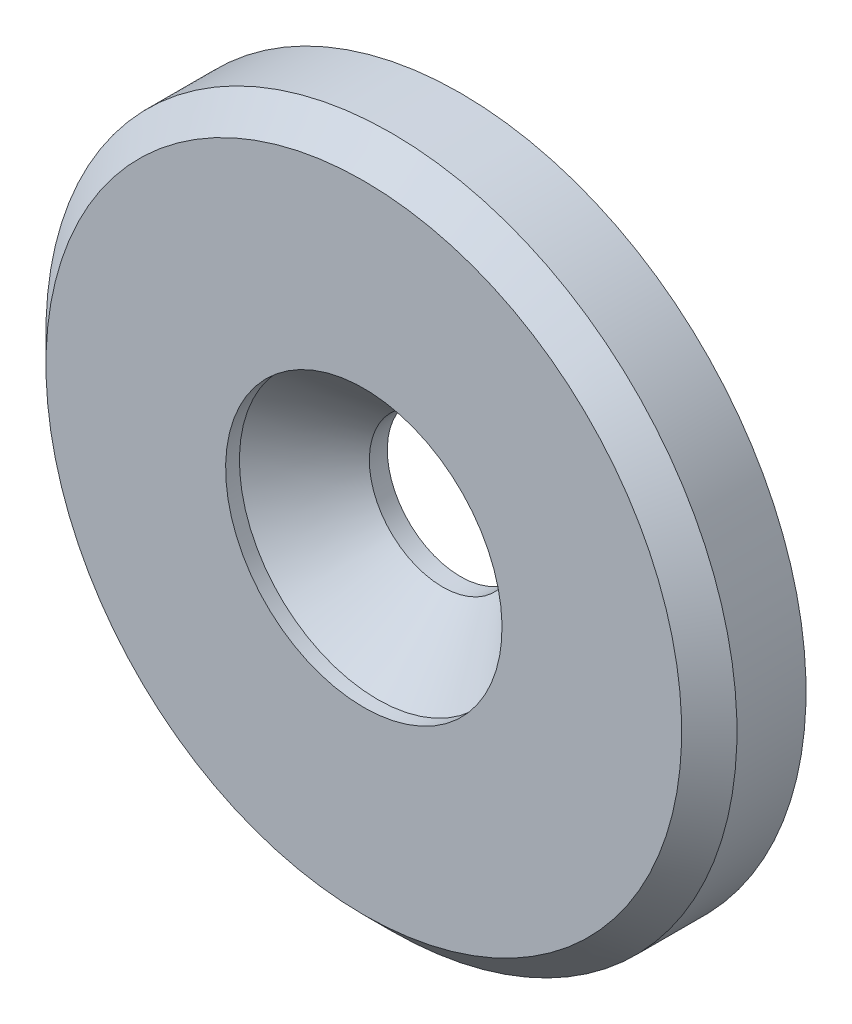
ISO-10303-21;
HEADER;
FILE_DESCRIPTION(('STEP AP214'),'2;1');
FILE_NAME('part.step','',(''),(''),'','','');
FILE_SCHEMA(('AUTOMOTIVE_DESIGN { 1 0 10303 214 1 1 1 1 }'));
ENDSEC;
DATA;
#1=APPLICATION_CONTEXT('core data for automotive mechanical design processes');
#2=APPLICATION_PROTOCOL_DEFINITION('international standard','automotive_design',2000,#1);
#3=PRODUCT_CONTEXT('',#1,'mechanical');
#4=PRODUCT('Part','Part','',(#3));
#5=PRODUCT_RELATED_PRODUCT_CATEGORY('part','',(#4));
#6=PRODUCT_DEFINITION_FORMATION('','',#4);
#7=PRODUCT_DEFINITION_CONTEXT('part definition',#1,'design');
#8=PRODUCT_DEFINITION('design','',#6,#7);
#9=PRODUCT_DEFINITION_SHAPE('','',#8);
#10=(LENGTH_UNIT() NAMED_UNIT(*) SI_UNIT(.MILLI.,.METRE.));
#11=(NAMED_UNIT(*) PLANE_ANGLE_UNIT() SI_UNIT($,.RADIAN.));
#12=(NAMED_UNIT(*) SI_UNIT($,.STERADIAN.) SOLID_ANGLE_UNIT());
#13=UNCERTAINTY_MEASURE_WITH_UNIT(LENGTH_MEASURE(1.E-05),#10,'distance_accuracy_value','');
#14=(GEOMETRIC_REPRESENTATION_CONTEXT(3) GLOBAL_UNCERTAINTY_ASSIGNED_CONTEXT((#13)) GLOBAL_UNIT_ASSIGNED_CONTEXT((#10,
#11,#12)) REPRESENTATION_CONTEXT('',''));
#15=CARTESIAN_POINT('',(0.,0.,0.));
#16=DIRECTION('',(0.,0.,1.));
#17=DIRECTION('',(1.,0.,0.));
#18=AXIS2_PLACEMENT_3D('',#15,#16,#17);
#19=CARTESIAN_POINT('',(0.,0.,0.65));
#20=DIRECTION('',(0.,0.,1.));
#21=DIRECTION('',(0.,-1.,0.));
#22=AXIS2_PLACEMENT_3D('',#19,#20,#21);
#23=CONICAL_SURFACE('',#22,2.65,0.785398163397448);
#24=CARTESIAN_POINT('',(0.,0.,3.));
#25=DIRECTION('',(0.,0.,1.));
#26=DIRECTION('',(0.,-1.,0.));
#27=AXIS2_PLACEMENT_3D('',#24,#25,#26);
#28=CIRCLE('',#27,5.);
#29=CARTESIAN_POINT('',(0.,-5.,3.));
#30=VERTEX_POINT('',#29);
#31=EDGE_CURVE('E37',#30,#30,#28,.T.);
#32=ORIENTED_EDGE('',*,*,#31,.T.);
#33=EDGE_LOOP('',(#32));
#34=FACE_BOUND('',#33,.T.);
#35=CARTESIAN_POINT('',(0.,0.,0.65));
#36=DIRECTION('',(0.,0.,1.));
#37=DIRECTION('',(0.,-1.,0.));
#38=AXIS2_PLACEMENT_3D('',#35,#36,#37);
#39=CIRCLE('',#38,2.65);
#40=CARTESIAN_POINT('',(0.,-2.65,0.65));
#41=VERTEX_POINT('',#40);
#42=EDGE_CURVE('E8',#41,#41,#39,.T.);
#43=ORIENTED_EDGE('',*,*,#42,.F.);
#44=EDGE_LOOP('',(#43));
#45=FACE_BOUND('',#44,.T.);
#46=ADVANCED_FACE('F12',(#34,#45),#23,.F.);
#47=CARTESIAN_POINT('',(0.,0.,3.87165171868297));
#48=DIRECTION('',(0.,0.,1.));
#49=DIRECTION('',(0.,-1.,0.));
#50=AXIS2_PLACEMENT_3D('',#47,#48,#49);
#51=CYLINDRICAL_SURFACE('',#50,2.65);
#52=ORIENTED_EDGE('',*,*,#42,.T.);
#53=EDGE_LOOP('',(#52));
#54=FACE_BOUND('',#53,.T.);
#55=CARTESIAN_POINT('',(0.,0.,0.));
#56=DIRECTION('',(0.,0.,1.));
#57=DIRECTION('',(0.,-1.,0.));
#58=AXIS2_PLACEMENT_3D('',#55,#56,#57);
#59=CIRCLE('',#58,2.65);
#60=CARTESIAN_POINT('',(0.,-2.65,0.));
#61=VERTEX_POINT('',#60);
#62=EDGE_CURVE('E18',#61,#61,#59,.T.);
#63=ORIENTED_EDGE('',*,*,#62,.F.);
#64=EDGE_LOOP('',(#63));
#65=FACE_BOUND('',#64,.T.);
#66=ADVANCED_FACE('F57',(#54,#65),#51,.F.);
#67=CARTESIAN_POINT('',(-2.65,0.,0.));
#68=DIRECTION('',(0.,0.,-1.));
#69=DIRECTION('',(0.,1.,0.));
#70=AXIS2_PLACEMENT_3D('',#67,#68,#69);
#71=PLANE('',#70);
#72=ORIENTED_EDGE('',*,*,#62,.T.);
#73=EDGE_LOOP('',(#72));
#74=FACE_BOUND('',#73,.T.);
#75=CARTESIAN_POINT('',(0.,0.,0.));
#76=DIRECTION('',(0.,0.,1.));
#77=DIRECTION('',(0.,-1.,0.));
#78=AXIS2_PLACEMENT_3D('',#75,#76,#77);
#79=CIRCLE('',#78,12.5);
#80=CARTESIAN_POINT('',(0.,-12.5,0.));
#81=VERTEX_POINT('',#80);
#82=EDGE_CURVE('E22',#81,#81,#79,.T.);
#83=ORIENTED_EDGE('',*,*,#82,.F.);
#84=EDGE_LOOP('',(#83));
#85=FACE_BOUND('',#84,.T.);
#86=ADVANCED_FACE('F62',(#74,#85),#71,.T.);
#87=CARTESIAN_POINT('',(0.,0.,3.87165171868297));
#88=DIRECTION('',(0.,0.,1.));
#89=DIRECTION('',(0.,-1.,0.));
#90=AXIS2_PLACEMENT_3D('',#87,#88,#89);
#91=CYLINDRICAL_SURFACE('',#90,12.5);
#92=ORIENTED_EDGE('',*,*,#82,.T.);
#93=EDGE_LOOP('',(#92));
#94=FACE_BOUND('',#93,.T.);
#95=CARTESIAN_POINT('',(0.,0.,2.5));
#96=DIRECTION('',(0.,0.,1.));
#97=DIRECTION('',(0.,-1.,0.));
#98=AXIS2_PLACEMENT_3D('',#95,#96,#97);
#99=CIRCLE('',#98,12.5);
#100=CARTESIAN_POINT('',(0.,-12.5,2.5));
#101=VERTEX_POINT('',#100);
#102=EDGE_CURVE('E26',#101,#101,#99,.T.);
#103=ORIENTED_EDGE('',*,*,#102,.F.);
#104=EDGE_LOOP('',(#103));
#105=FACE_BOUND('',#104,.T.);
#106=ADVANCED_FACE('F67',(#94,#105),#91,.T.);
#107=CARTESIAN_POINT('',(0.,0.,3.5));
#108=DIRECTION('',(0.,0.,-1.));
#109=DIRECTION('',(0.,1.,0.));
#110=AXIS2_PLACEMENT_3D('',#107,#108,#109);
#111=CONICAL_SURFACE('',#110,11.5,0.785398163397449);
#112=ORIENTED_EDGE('',*,*,#102,.T.);
#113=EDGE_LOOP('',(#112));
#114=FACE_BOUND('',#113,.T.);
#115=CARTESIAN_POINT('',(0.,0.,3.5));
#116=DIRECTION('',(0.,0.,1.));
#117=DIRECTION('',(0.,-1.,0.));
#118=AXIS2_PLACEMENT_3D('',#115,#116,#117);
#119=CIRCLE('',#118,11.5);
#120=CARTESIAN_POINT('',(0.,-11.5,3.5));
#121=VERTEX_POINT('',#120);
#122=EDGE_CURVE('E31',#121,#121,#119,.T.);
#123=ORIENTED_EDGE('',*,*,#122,.F.);
#124=EDGE_LOOP('',(#123));
#125=FACE_BOUND('',#124,.T.);
#126=ADVANCED_FACE('F53',(#114,#125),#111,.T.);
#127=CARTESIAN_POINT('',(-5.,0.,3.5));
#128=DIRECTION('',(0.,0.,1.));
#129=DIRECTION('',(0.,-1.,0.));
#130=AXIS2_PLACEMENT_3D('',#127,#128,#129);
#131=PLANE('',#130);
#132=ORIENTED_EDGE('',*,*,#122,.T.);
#133=EDGE_LOOP('',(#132));
#134=FACE_BOUND('',#133,.T.);
#135=CARTESIAN_POINT('',(0.,0.,3.5));
#136=DIRECTION('',(0.,0.,1.));
#137=DIRECTION('',(0.,-1.,0.));
#138=AXIS2_PLACEMENT_3D('',#135,#136,#137);
#139=CIRCLE('',#138,5.);
#140=CARTESIAN_POINT('',(0.,-5.,3.5));
#141=VERTEX_POINT('',#140);
#142=EDGE_CURVE('E34',#141,#141,#139,.T.);
#143=ORIENTED_EDGE('',*,*,#142,.F.);
#144=EDGE_LOOP('',(#143));
#145=FACE_BOUND('',#144,.T.);
#146=ADVANCED_FACE('F45',(#134,#145),#131,.T.);
#147=CARTESIAN_POINT('',(0.,0.,3.87165171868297));
#148=DIRECTION('',(0.,0.,1.));
#149=DIRECTION('',(0.,-1.,0.));
#150=AXIS2_PLACEMENT_3D('',#147,#148,#149);
#151=CYLINDRICAL_SURFACE('',#150,5.);
#152=ORIENTED_EDGE('',*,*,#142,.T.);
#153=EDGE_LOOP('',(#152));
#154=FACE_BOUND('',#153,.T.);
#155=ORIENTED_EDGE('',*,*,#31,.F.);
#156=EDGE_LOOP('',(#155));
#157=FACE_BOUND('',#156,.T.);
#158=ADVANCED_FACE('F43',(#154,#157),#151,.F.);
#159=CLOSED_SHELL('',(#46,#66,#86,#106,#126,#146,#158));
#160=MANIFOLD_SOLID_BREP('B1',#159);
#161=ADVANCED_BREP_SHAPE_REPRESENTATION('',(#18,#160),#14);
#162=SHAPE_DEFINITION_REPRESENTATION(#9,#161);
ENDSEC;
END-ISO-10303-21;
